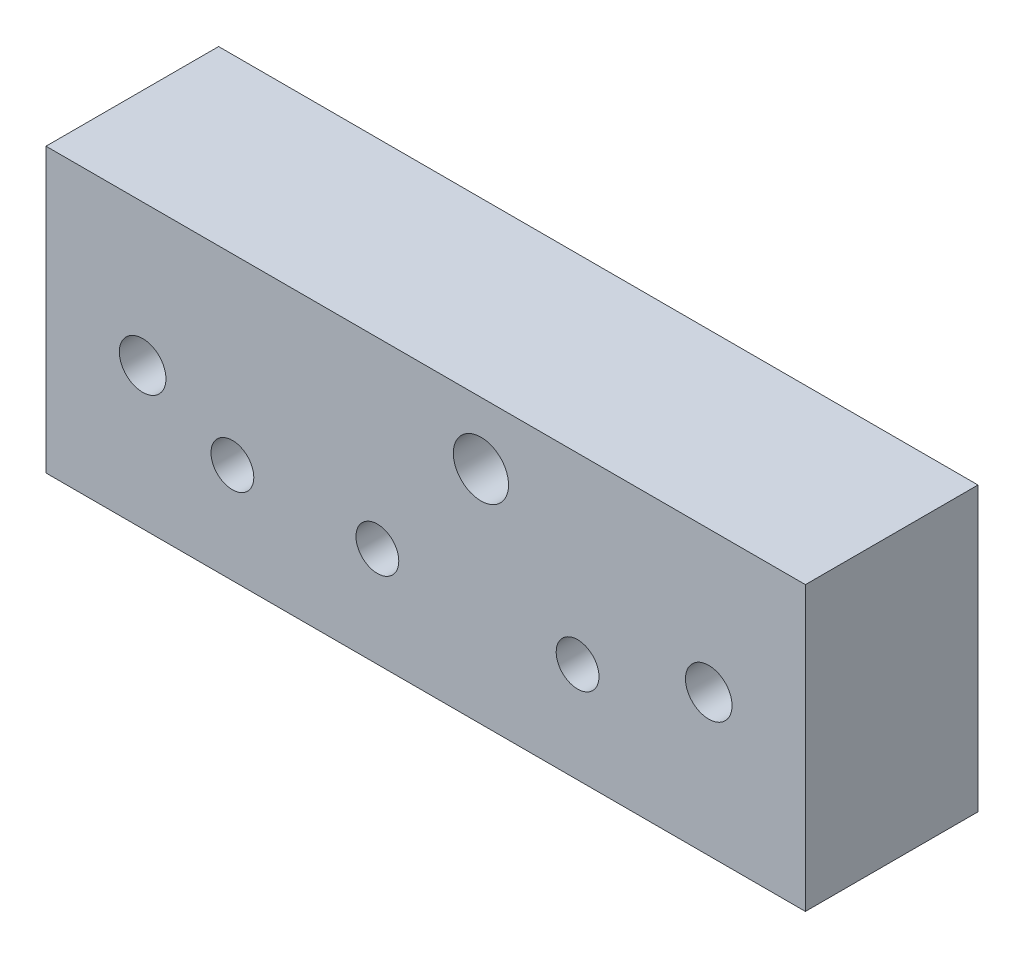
ISO-10303-21;
HEADER;
FILE_DESCRIPTION(('STEP AP214'),'2;1');
FILE_NAME('part.step','',(''),(''),'','','');
FILE_SCHEMA(('AUTOMOTIVE_DESIGN { 1 0 10303 214 1 1 1 1 }'));
ENDSEC;
DATA;
#1=APPLICATION_CONTEXT('core data for automotive mechanical design processes');
#2=APPLICATION_PROTOCOL_DEFINITION('international standard','automotive_design',2000,#1);
#3=PRODUCT_CONTEXT('',#1,'mechanical');
#4=PRODUCT('Part','Part','',(#3));
#5=PRODUCT_RELATED_PRODUCT_CATEGORY('part','',(#4));
#6=PRODUCT_DEFINITION_FORMATION('','',#4);
#7=PRODUCT_DEFINITION_CONTEXT('part definition',#1,'design');
#8=PRODUCT_DEFINITION('design','',#6,#7);
#9=PRODUCT_DEFINITION_SHAPE('','',#8);
#10=(LENGTH_UNIT() NAMED_UNIT(*) SI_UNIT(.MILLI.,.METRE.));
#11=(NAMED_UNIT(*) PLANE_ANGLE_UNIT() SI_UNIT($,.RADIAN.));
#12=(NAMED_UNIT(*) SI_UNIT($,.STERADIAN.) SOLID_ANGLE_UNIT());
#13=UNCERTAINTY_MEASURE_WITH_UNIT(LENGTH_MEASURE(1.E-05),#10,'distance_accuracy_value','');
#14=(GEOMETRIC_REPRESENTATION_CONTEXT(3) GLOBAL_UNCERTAINTY_ASSIGNED_CONTEXT((#13)) GLOBAL_UNIT_ASSIGNED_CONTEXT((#10,
#11,#12)) REPRESENTATION_CONTEXT('',''));
#15=CARTESIAN_POINT('',(0.,0.,0.));
#16=DIRECTION('',(0.,0.,1.));
#17=DIRECTION('',(1.,0.,0.));
#18=AXIS2_PLACEMENT_3D('',#15,#16,#17);
#19=CARTESIAN_POINT('',(325.,123.,25.));
#20=DIRECTION('',(0.,0.,1.));
#21=DIRECTION('',(1.,0.,0.));
#22=AXIS2_PLACEMENT_3D('',#19,#20,#21);
#23=PLANE('',#22);
#24=CARTESIAN_POINT('',(278.,114.,25.));
#25=DIRECTION('',(0.,0.,1.));
#26=DIRECTION('',(1.,0.,0.));
#27=AXIS2_PLACEMENT_3D('',#24,#25,#26);
#28=CIRCLE('',#27,3.99999999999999);
#29=CARTESIAN_POINT('',(282.,114.,25.));
#30=VERTEX_POINT('',#29);
#31=EDGE_CURVE('E285',#30,#30,#28,.T.);
#32=ORIENTED_EDGE('',*,*,#31,.F.);
#33=EDGE_LOOP('',(#32));
#34=FACE_BOUND('',#33,.T.);
#35=CARTESIAN_POINT('',(229.,102.5,25.));
#36=DIRECTION('',(0.,0.,1.));
#37=DIRECTION('',(1.,0.,0.));
#38=AXIS2_PLACEMENT_3D('',#35,#36,#37);
#39=CIRCLE('',#38,3.37499999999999);
#40=CARTESIAN_POINT('',(232.375,102.5,25.));
#41=VERTEX_POINT('',#40);
#42=EDGE_CURVE('E287',#41,#41,#39,.T.);
#43=ORIENTED_EDGE('',*,*,#42,.F.);
#44=EDGE_LOOP('',(#43));
#45=FACE_BOUND('',#44,.T.);
#46=CARTESIAN_POINT('',(311.,102.5,25.));
#47=DIRECTION('',(0.,0.,1.));
#48=DIRECTION('',(1.,0.,0.));
#49=AXIS2_PLACEMENT_3D('',#46,#47,#48);
#50=CIRCLE('',#49,3.37500000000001);
#51=CARTESIAN_POINT('',(314.375,102.5,25.));
#52=VERTEX_POINT('',#51);
#53=EDGE_CURVE('E295',#52,#52,#50,.T.);
#54=ORIENTED_EDGE('',*,*,#53,.F.);
#55=EDGE_LOOP('',(#54));
#56=FACE_BOUND('',#55,.T.);
#57=CARTESIAN_POINT('',(263.,96.5,25.));
#58=DIRECTION('',(0.,0.,1.));
#59=DIRECTION('',(1.,0.,0.));
#60=AXIS2_PLACEMENT_3D('',#57,#58,#59);
#61=CIRCLE('',#60,3.09999999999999);
#62=CARTESIAN_POINT('',(266.1,96.5,25.));
#63=VERTEX_POINT('',#62);
#64=EDGE_CURVE('E94',#63,#63,#61,.T.);
#65=ORIENTED_EDGE('',*,*,#64,.F.);
#66=EDGE_LOOP('',(#65));
#67=FACE_BOUND('',#66,.T.);
#68=DIRECTION('',(0.,1.,0.));
#69=VECTOR('',#68,1.);
#70=CARTESIAN_POINT('',(325.,82.,25.));
#71=LINE('',#70,#69);
#72=CARTESIAN_POINT('',(325.,82.,25.));
#73=VERTEX_POINT('',#72);
#74=CARTESIAN_POINT('',(325.,123.,25.));
#75=VERTEX_POINT('',#74);
#76=EDGE_CURVE('E101',#73,#75,#71,.T.);
#77=ORIENTED_EDGE('',*,*,#76,.T.);
#78=DIRECTION('',(-1.,0.,0.));
#79=VECTOR('',#78,1.);
#80=CARTESIAN_POINT('',(325.,123.,25.));
#81=LINE('',#80,#79);
#82=CARTESIAN_POINT('',(215.,123.,25.));
#83=VERTEX_POINT('',#82);
#84=EDGE_CURVE('E86',#75,#83,#81,.T.);
#85=ORIENTED_EDGE('',*,*,#84,.T.);
#86=DIRECTION('',(0.,-1.,0.));
#87=VECTOR('',#86,1.);
#88=CARTESIAN_POINT('',(215.,82.,25.));
#89=LINE('',#88,#87);
#90=CARTESIAN_POINT('',(215.,82.,25.));
#91=VERTEX_POINT('',#90);
#92=EDGE_CURVE('E53',#83,#91,#89,.T.);
#93=ORIENTED_EDGE('',*,*,#92,.T.);
#94=DIRECTION('',(1.,0.,0.));
#95=VECTOR('',#94,1.);
#96=CARTESIAN_POINT('',(325.,82.,25.));
#97=LINE('',#96,#95);
#98=EDGE_CURVE('E48',#91,#73,#97,.T.);
#99=ORIENTED_EDGE('',*,*,#98,.T.);
#100=EDGE_LOOP('',(#77,#85,#93,#99));
#101=FACE_BOUND('',#100,.T.);
#102=CARTESIAN_POINT('',(292.,96.5,25.));
#103=DIRECTION('',(0.,0.,1.));
#104=DIRECTION('',(1.,0.,0.));
#105=AXIS2_PLACEMENT_3D('',#102,#103,#104);
#106=CIRCLE('',#105,3.09999999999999);
#107=CARTESIAN_POINT('',(295.1,96.5,25.));
#108=VERTEX_POINT('',#107);
#109=EDGE_CURVE('E91',#108,#108,#106,.T.);
#110=ORIENTED_EDGE('',*,*,#109,.F.);
#111=EDGE_LOOP('',(#110));
#112=FACE_BOUND('',#111,.T.);
#113=CARTESIAN_POINT('',(242.,96.5,25.));
#114=DIRECTION('',(0.,0.,1.));
#115=DIRECTION('',(1.,0.,0.));
#116=AXIS2_PLACEMENT_3D('',#113,#114,#115);
#117=CIRCLE('',#116,3.09999999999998);
#118=CARTESIAN_POINT('',(245.1,96.5,25.));
#119=VERTEX_POINT('',#118);
#120=EDGE_CURVE('E113',#119,#119,#117,.T.);
#121=ORIENTED_EDGE('',*,*,#120,.F.);
#122=EDGE_LOOP('',(#121));
#123=FACE_BOUND('',#122,.T.);
#124=ADVANCED_FACE('F31',(#34,#45,#56,#67,#101,#112,#123),#23,.T.);
#125=CARTESIAN_POINT('',(325.,123.,0.));
#126=DIRECTION('',(0.,0.,1.));
#127=DIRECTION('',(1.,0.,0.));
#128=AXIS2_PLACEMENT_3D('',#125,#126,#127);
#129=PLANE('',#128);
#130=CARTESIAN_POINT('',(278.,114.,0.));
#131=DIRECTION('',(0.,0.,1.));
#132=DIRECTION('',(1.,0.,0.));
#133=AXIS2_PLACEMENT_3D('',#130,#131,#132);
#134=CIRCLE('',#133,3.99999999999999);
#135=CARTESIAN_POINT('',(282.,114.,0.));
#136=VERTEX_POINT('',#135);
#137=EDGE_CURVE('E282',#136,#136,#134,.T.);
#138=ORIENTED_EDGE('',*,*,#137,.T.);
#139=EDGE_LOOP('',(#138));
#140=FACE_BOUND('',#139,.T.);
#141=CARTESIAN_POINT('',(229.,102.5,0.));
#142=DIRECTION('',(0.,0.,1.));
#143=DIRECTION('',(1.,0.,0.));
#144=AXIS2_PLACEMENT_3D('',#141,#142,#143);
#145=CIRCLE('',#144,3.37499999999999);
#146=CARTESIAN_POINT('',(232.375,102.5,0.));
#147=VERTEX_POINT('',#146);
#148=EDGE_CURVE('E292',#147,#147,#145,.T.);
#149=ORIENTED_EDGE('',*,*,#148,.T.);
#150=EDGE_LOOP('',(#149));
#151=FACE_BOUND('',#150,.T.);
#152=CARTESIAN_POINT('',(311.,102.5,0.));
#153=DIRECTION('',(0.,0.,1.));
#154=DIRECTION('',(1.,0.,0.));
#155=AXIS2_PLACEMENT_3D('',#152,#153,#154);
#156=CIRCLE('',#155,3.37500000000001);
#157=CARTESIAN_POINT('',(314.375,102.5,0.));
#158=VERTEX_POINT('',#157);
#159=EDGE_CURVE('E297',#158,#158,#156,.T.);
#160=ORIENTED_EDGE('',*,*,#159,.T.);
#161=EDGE_LOOP('',(#160));
#162=FACE_BOUND('',#161,.T.);
#163=CARTESIAN_POINT('',(292.,96.5,0.));
#164=DIRECTION('',(0.,0.,-1.));
#165=DIRECTION('',(-1.,0.,0.));
#166=AXIS2_PLACEMENT_3D('',#163,#164,#165);
#167=CIRCLE('',#166,4.09999999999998);
#168=CARTESIAN_POINT('',(287.9,96.5,0.));
#169=VERTEX_POINT('',#168);
#170=EDGE_CURVE('E127',#169,#169,#167,.T.);
#171=ORIENTED_EDGE('',*,*,#170,.F.);
#172=EDGE_LOOP('',(#171));
#173=FACE_BOUND('',#172,.T.);
#174=CARTESIAN_POINT('',(263.,96.5,0.));
#175=DIRECTION('',(0.,0.,-1.));
#176=DIRECTION('',(-1.,0.,0.));
#177=AXIS2_PLACEMENT_3D('',#174,#175,#176);
#178=CIRCLE('',#177,4.09999999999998);
#179=CARTESIAN_POINT('',(258.9,96.5,0.));
#180=VERTEX_POINT('',#179);
#181=EDGE_CURVE('E117',#180,#180,#178,.T.);
#182=ORIENTED_EDGE('',*,*,#181,.F.);
#183=EDGE_LOOP('',(#182));
#184=FACE_BOUND('',#183,.T.);
#185=CARTESIAN_POINT('',(242.,96.5,0.));
#186=DIRECTION('',(0.,0.,-1.));
#187=DIRECTION('',(-1.,0.,0.));
#188=AXIS2_PLACEMENT_3D('',#185,#186,#187);
#189=CIRCLE('',#188,4.09999999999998);
#190=CARTESIAN_POINT('',(237.9,96.5,0.));
#191=VERTEX_POINT('',#190);
#192=EDGE_CURVE('E114',#191,#191,#189,.T.);
#193=ORIENTED_EDGE('',*,*,#192,.F.);
#194=EDGE_LOOP('',(#193));
#195=FACE_BOUND('',#194,.T.);
#196=DIRECTION('',(0.,1.,0.));
#197=VECTOR('',#196,1.);
#198=CARTESIAN_POINT('',(325.,82.,0.));
#199=LINE('',#198,#197);
#200=CARTESIAN_POINT('',(325.,82.,0.));
#201=VERTEX_POINT('',#200);
#202=CARTESIAN_POINT('',(325.,123.,0.));
#203=VERTEX_POINT('',#202);
#204=EDGE_CURVE('E78',#201,#203,#199,.T.);
#205=ORIENTED_EDGE('',*,*,#204,.F.);
#206=DIRECTION('',(1.,0.,0.));
#207=VECTOR('',#206,1.);
#208=CARTESIAN_POINT('',(325.,82.,0.));
#209=LINE('',#208,#207);
#210=CARTESIAN_POINT('',(215.,82.,0.));
#211=VERTEX_POINT('',#210);
#212=EDGE_CURVE('E99',#211,#201,#209,.T.);
#213=ORIENTED_EDGE('',*,*,#212,.F.);
#214=DIRECTION('',(0.,-1.,0.));
#215=VECTOR('',#214,1.);
#216=CARTESIAN_POINT('',(215.,82.,0.));
#217=LINE('',#216,#215);
#218=CARTESIAN_POINT('',(215.,123.,0.));
#219=VERTEX_POINT('',#218);
#220=EDGE_CURVE('E79',#219,#211,#217,.T.);
#221=ORIENTED_EDGE('',*,*,#220,.F.);
#222=DIRECTION('',(-1.,0.,0.));
#223=VECTOR('',#222,1.);
#224=CARTESIAN_POINT('',(325.,123.,0.));
#225=LINE('',#224,#223);
#226=EDGE_CURVE('E74',#203,#219,#225,.T.);
#227=ORIENTED_EDGE('',*,*,#226,.F.);
#228=EDGE_LOOP('',(#205,#213,#221,#227));
#229=FACE_BOUND('',#228,.T.);
#230=ADVANCED_FACE('F75',(#140,#151,#162,#173,#184,#195,#229),#129,.F.);
#231=CARTESIAN_POINT('',(325.,82.,25.));
#232=DIRECTION('',(-1.,0.,0.));
#233=DIRECTION('',(0.,0.,1.));
#234=AXIS2_PLACEMENT_3D('',#231,#232,#233);
#235=PLANE('',#234);
#236=ORIENTED_EDGE('',*,*,#204,.T.);
#237=DIRECTION('',(0.,0.,-1.));
#238=VECTOR('',#237,1.);
#239=CARTESIAN_POINT('',(325.,123.,25.));
#240=LINE('',#239,#238);
#241=EDGE_CURVE('E11',#75,#203,#240,.T.);
#242=ORIENTED_EDGE('',*,*,#241,.F.);
#243=ORIENTED_EDGE('',*,*,#76,.F.);
#244=DIRECTION('',(0.,0.,-1.));
#245=VECTOR('',#244,1.);
#246=CARTESIAN_POINT('',(325.,82.,25.));
#247=LINE('',#246,#245);
#248=EDGE_CURVE('E90',#73,#201,#247,.T.);
#249=ORIENTED_EDGE('',*,*,#248,.T.);
#250=EDGE_LOOP('',(#236,#242,#243,#249));
#251=FACE_BOUND('',#250,.T.);
#252=ADVANCED_FACE('F33',(#251),#235,.F.);
#253=CARTESIAN_POINT('',(325.,123.,25.));
#254=DIRECTION('',(0.,-1.,0.));
#255=DIRECTION('',(0.,0.,-1.));
#256=AXIS2_PLACEMENT_3D('',#253,#254,#255);
#257=PLANE('',#256);
#258=ORIENTED_EDGE('',*,*,#226,.T.);
#259=DIRECTION('',(0.,0.,-1.));
#260=VECTOR('',#259,1.);
#261=CARTESIAN_POINT('',(215.,123.,25.));
#262=LINE('',#261,#260);
#263=EDGE_CURVE('E40',#83,#219,#262,.T.);
#264=ORIENTED_EDGE('',*,*,#263,.F.);
#265=ORIENTED_EDGE('',*,*,#84,.F.);
#266=ORIENTED_EDGE('',*,*,#241,.T.);
#267=EDGE_LOOP('',(#258,#264,#265,#266));
#268=FACE_BOUND('',#267,.T.);
#269=ADVANCED_FACE('F85',(#268),#257,.F.);
#270=CARTESIAN_POINT('',(215.,82.,25.));
#271=DIRECTION('',(1.,0.,0.));
#272=DIRECTION('',(0.,0.,-1.));
#273=AXIS2_PLACEMENT_3D('',#270,#271,#272);
#274=PLANE('',#273);
#275=ORIENTED_EDGE('',*,*,#220,.T.);
#276=DIRECTION('',(0.,0.,-1.));
#277=VECTOR('',#276,1.);
#278=CARTESIAN_POINT('',(215.,82.,25.));
#279=LINE('',#278,#277);
#280=EDGE_CURVE('E107',#91,#211,#279,.T.);
#281=ORIENTED_EDGE('',*,*,#280,.F.);
#282=ORIENTED_EDGE('',*,*,#92,.F.);
#283=ORIENTED_EDGE('',*,*,#263,.T.);
#284=EDGE_LOOP('',(#275,#281,#282,#283));
#285=FACE_BOUND('',#284,.T.);
#286=ADVANCED_FACE('F172',(#285),#274,.F.);
#287=CARTESIAN_POINT('',(325.,82.,25.));
#288=DIRECTION('',(0.,1.,0.));
#289=DIRECTION('',(-1.,0.,0.));
#290=AXIS2_PLACEMENT_3D('',#287,#288,#289);
#291=PLANE('',#290);
#292=ORIENTED_EDGE('',*,*,#212,.T.);
#293=ORIENTED_EDGE('',*,*,#248,.F.);
#294=ORIENTED_EDGE('',*,*,#98,.F.);
#295=ORIENTED_EDGE('',*,*,#280,.T.);
#296=EDGE_LOOP('',(#292,#293,#294,#295));
#297=FACE_BOUND('',#296,.T.);
#298=ADVANCED_FACE('F165',(#297),#291,.F.);
#299=CARTESIAN_POINT('',(292.,96.5,25.));
#300=DIRECTION('',(0.,0.,-1.));
#301=DIRECTION('',(-1.,0.,0.));
#302=AXIS2_PLACEMENT_3D('',#299,#300,#301);
#303=CYLINDRICAL_SURFACE('',#302,3.09999999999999);
#304=CARTESIAN_POINT('',(292.,96.5,19.0811366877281));
#305=DIRECTION('',(0.,0.,-1.));
#306=DIRECTION('',(-1.,0.,0.));
#307=AXIS2_PLACEMENT_3D('',#304,#305,#306);
#308=CIRCLE('',#307,3.09999999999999);
#309=CARTESIAN_POINT('',(288.9,96.5,19.0811366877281));
#310=VERTEX_POINT('',#309);
#311=EDGE_CURVE('E35',#310,#310,#308,.F.);
#312=ORIENTED_EDGE('',*,*,#311,.F.);
#313=EDGE_LOOP('',(#312));
#314=FACE_BOUND('',#313,.T.);
#315=ORIENTED_EDGE('',*,*,#109,.T.);
#316=EDGE_LOOP('',(#315));
#317=FACE_BOUND('',#316,.T.);
#318=ADVANCED_FACE('F157',(#314,#317),#303,.F.);
#319=CARTESIAN_POINT('',(263.,96.5,25.));
#320=DIRECTION('',(0.,0.,-1.));
#321=DIRECTION('',(-1.,0.,0.));
#322=AXIS2_PLACEMENT_3D('',#319,#320,#321);
#323=CYLINDRICAL_SURFACE('',#322,3.09999999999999);
#324=CARTESIAN_POINT('',(263.,96.5,19.0811366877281));
#325=DIRECTION('',(0.,0.,-1.));
#326=DIRECTION('',(-1.,0.,0.));
#327=AXIS2_PLACEMENT_3D('',#324,#325,#326);
#328=CIRCLE('',#327,3.09999999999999);
#329=CARTESIAN_POINT('',(259.9,96.5,19.0811366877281));
#330=VERTEX_POINT('',#329);
#331=EDGE_CURVE('E115',#330,#330,#328,.F.);
#332=ORIENTED_EDGE('',*,*,#331,.F.);
#333=EDGE_LOOP('',(#332));
#334=FACE_BOUND('',#333,.T.);
#335=ORIENTED_EDGE('',*,*,#64,.T.);
#336=EDGE_LOOP('',(#335));
#337=FACE_BOUND('',#336,.T.);
#338=ADVANCED_FACE('F135',(#334,#337),#323,.F.);
#339=CARTESIAN_POINT('',(242.,96.5,25.));
#340=DIRECTION('',(0.,0.,-1.));
#341=DIRECTION('',(-1.,0.,0.));
#342=AXIS2_PLACEMENT_3D('',#339,#340,#341);
#343=CYLINDRICAL_SURFACE('',#342,3.09999999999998);
#344=CARTESIAN_POINT('',(242.,96.5,19.0811366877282));
#345=DIRECTION('',(0.,0.,-1.));
#346=DIRECTION('',(-1.,0.,0.));
#347=AXIS2_PLACEMENT_3D('',#344,#345,#346);
#348=CIRCLE('',#347,3.09999999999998);
#349=CARTESIAN_POINT('',(238.9,96.5,19.0811366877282));
#350=VERTEX_POINT('',#349);
#351=EDGE_CURVE('E111',#350,#350,#348,.F.);
#352=ORIENTED_EDGE('',*,*,#351,.F.);
#353=EDGE_LOOP('',(#352));
#354=FACE_BOUND('',#353,.T.);
#355=ORIENTED_EDGE('',*,*,#120,.T.);
#356=EDGE_LOOP('',(#355));
#357=FACE_BOUND('',#356,.T.);
#358=ADVANCED_FACE('F145',(#354,#357),#343,.F.);
#359=CARTESIAN_POINT('',(242.,96.5,0.));
#360=DIRECTION('',(0.,0.,-1.));
#361=DIRECTION('',(-1.,0.,0.));
#362=AXIS2_PLACEMENT_3D('',#359,#360,#361);
#363=CONICAL_SURFACE('',#362,4.09999999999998,0.05235987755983);
#364=ORIENTED_EDGE('',*,*,#351,.T.);
#365=EDGE_LOOP('',(#364));
#366=FACE_BOUND('',#365,.T.);
#367=ORIENTED_EDGE('',*,*,#192,.T.);
#368=EDGE_LOOP('',(#367));
#369=FACE_BOUND('',#368,.T.);
#370=ADVANCED_FACE('F147',(#366,#369),#363,.F.);
#371=CARTESIAN_POINT('',(263.,96.5,0.));
#372=DIRECTION('',(0.,0.,-1.));
#373=DIRECTION('',(-1.,0.,0.));
#374=AXIS2_PLACEMENT_3D('',#371,#372,#373);
#375=CONICAL_SURFACE('',#374,4.09999999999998,0.05235987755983);
#376=ORIENTED_EDGE('',*,*,#331,.T.);
#377=EDGE_LOOP('',(#376));
#378=FACE_BOUND('',#377,.T.);
#379=ORIENTED_EDGE('',*,*,#181,.T.);
#380=EDGE_LOOP('',(#379));
#381=FACE_BOUND('',#380,.T.);
#382=ADVANCED_FACE('F154',(#378,#381),#375,.F.);
#383=CARTESIAN_POINT('',(292.,96.5,0.));
#384=DIRECTION('',(0.,0.,-1.));
#385=DIRECTION('',(-1.,0.,0.));
#386=AXIS2_PLACEMENT_3D('',#383,#384,#385);
#387=CONICAL_SURFACE('',#386,4.09999999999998,0.05235987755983);
#388=ORIENTED_EDGE('',*,*,#311,.T.);
#389=EDGE_LOOP('',(#388));
#390=FACE_BOUND('',#389,.T.);
#391=ORIENTED_EDGE('',*,*,#170,.T.);
#392=EDGE_LOOP('',(#391));
#393=FACE_BOUND('',#392,.T.);
#394=ADVANCED_FACE('F237',(#390,#393),#387,.F.);
#395=CARTESIAN_POINT('',(311.,102.5,0.));
#396=DIRECTION('',(0.,0.,1.));
#397=DIRECTION('',(1.,0.,0.));
#398=AXIS2_PLACEMENT_3D('',#395,#396,#397);
#399=CYLINDRICAL_SURFACE('',#398,3.37500000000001);
#400=ORIENTED_EDGE('',*,*,#159,.F.);
#401=EDGE_LOOP('',(#400));
#402=FACE_BOUND('',#401,.T.);
#403=ORIENTED_EDGE('',*,*,#53,.T.);
#404=EDGE_LOOP('',(#403));
#405=FACE_BOUND('',#404,.T.);
#406=ADVANCED_FACE('F244',(#402,#405),#399,.F.);
#407=CARTESIAN_POINT('',(229.,102.5,0.));
#408=DIRECTION('',(0.,0.,1.));
#409=DIRECTION('',(1.,0.,0.));
#410=AXIS2_PLACEMENT_3D('',#407,#408,#409);
#411=CYLINDRICAL_SURFACE('',#410,3.37499999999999);
#412=ORIENTED_EDGE('',*,*,#148,.F.);
#413=EDGE_LOOP('',(#412));
#414=FACE_BOUND('',#413,.T.);
#415=ORIENTED_EDGE('',*,*,#42,.T.);
#416=EDGE_LOOP('',(#415));
#417=FACE_BOUND('',#416,.T.);
#418=ADVANCED_FACE('F253',(#414,#417),#411,.F.);
#419=CARTESIAN_POINT('',(278.,114.,0.));
#420=DIRECTION('',(0.,0.,1.));
#421=DIRECTION('',(1.,0.,0.));
#422=AXIS2_PLACEMENT_3D('',#419,#420,#421);
#423=CYLINDRICAL_SURFACE('',#422,3.99999999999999);
#424=ORIENTED_EDGE('',*,*,#137,.F.);
#425=EDGE_LOOP('',(#424));
#426=FACE_BOUND('',#425,.T.);
#427=ORIENTED_EDGE('',*,*,#31,.T.);
#428=EDGE_LOOP('',(#427));
#429=FACE_BOUND('',#428,.T.);
#430=ADVANCED_FACE('F262',(#426,#429),#423,.F.);
#431=CLOSED_SHELL('',(#124,#230,#252,#269,#286,#298,#318,#338,#358,#370,#382,#394,#406,#418,#430));
#432=MANIFOLD_SOLID_BREP('B2',#431);
#433=ADVANCED_BREP_SHAPE_REPRESENTATION('',(#18,#432),#14);
#434=SHAPE_DEFINITION_REPRESENTATION(#9,#433);
ENDSEC;
END-ISO-10303-21;
